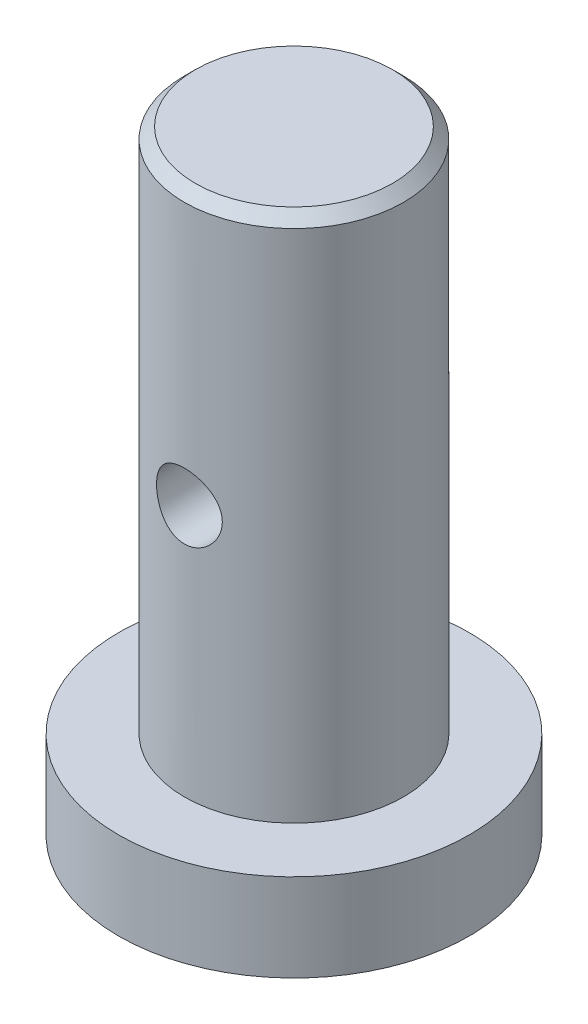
from build123d import *

# Parameters (mm, degrees)
CHANFREIN1_SIZE              = 0.5
ENL_V_MAT_EXTRU_1_DEPTH      = 31.199337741
ENL_V_MAT_EXTRU_1_DEPTH_BACK = 31.199337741
ESQUISSE2_R                  = 1.5


with BuildPart() as part:
    # Esquisse1 → Base-R_volution (revolve)
    with BuildSketch(Plane.XY, mode=Mode.PRIVATE) as base_r_volution_sk:
        Polygon((0, 28), (0, 0), (8, 0), (8, 4), (5, 4), (5, 28), align=None)
    revolve(base_r_volution_sk.sketch.rotate(Axis((0, 103.591101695, 0), (0, -1, 0)), 90), axis=Axis((0, 103.591101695, 0), (0, -1, 0)))

    # Chanfrein1
    chanfrein1_edges = [part.edges().sort_by_distance(p)[0] for p in [
        (0, 28, -5),
    ]]
    chamfer(chanfrein1_edges, length=CHANFREIN1_SIZE)

    # Esquisse2 → Enl_v. mat.-Extru.1 (cut, two sides: drawn at the far end of the back side and taken through both)
    with BuildSketch(Plane.XY.offset(-ENL_V_MAT_EXTRU_1_DEPTH_BACK)):
        with Locations((0, 15.5)):
            Circle(ESQUISSE2_R)
    extrude(amount=ENL_V_MAT_EXTRU_1_DEPTH + ENL_V_MAT_EXTRU_1_DEPTH_BACK, mode=Mode.SUBTRACT)


solid = part.part
